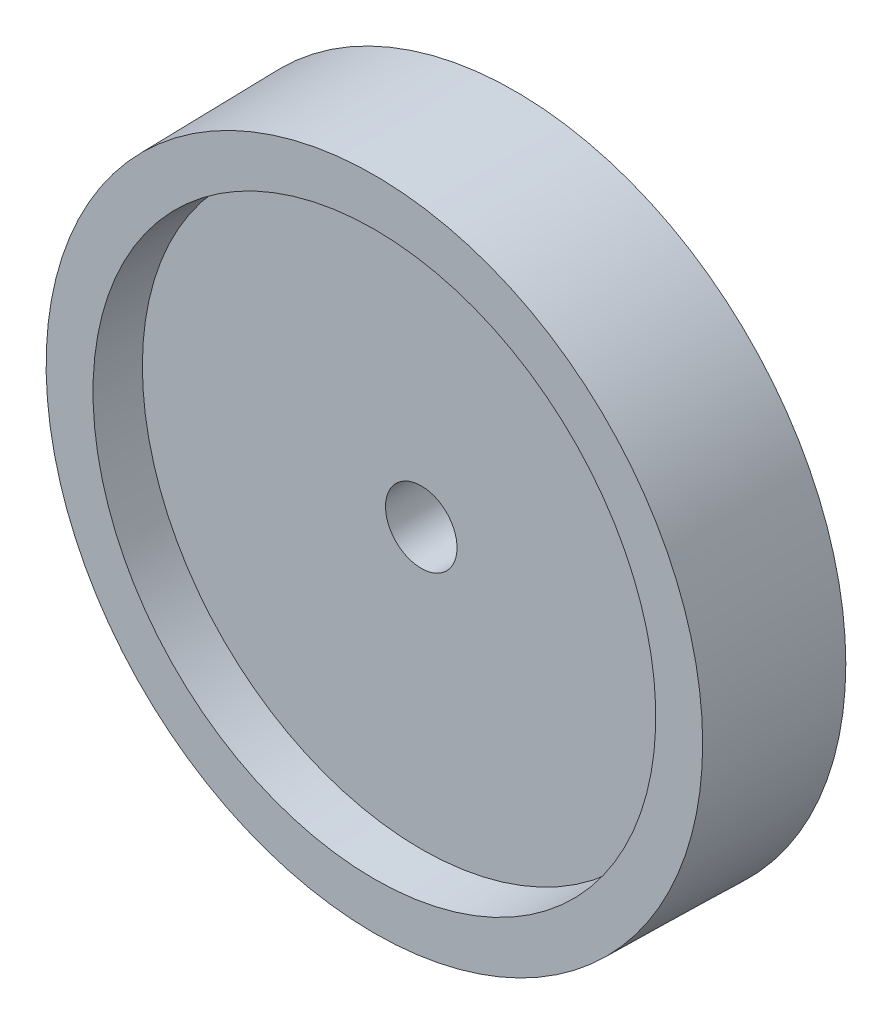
ISO-10303-21;
HEADER;
FILE_DESCRIPTION(('STEP AP214'),'2;1');
FILE_NAME('part.step','',(''),(''),'','','');
FILE_SCHEMA(('AUTOMOTIVE_DESIGN { 1 0 10303 214 1 1 1 1 }'));
ENDSEC;
DATA;
#1=APPLICATION_CONTEXT('core data for automotive mechanical design processes');
#2=APPLICATION_PROTOCOL_DEFINITION('international standard','automotive_design',2000,#1);
#3=PRODUCT_CONTEXT('',#1,'mechanical');
#4=PRODUCT('Part','Part','',(#3));
#5=PRODUCT_RELATED_PRODUCT_CATEGORY('part','',(#4));
#6=PRODUCT_DEFINITION_FORMATION('','',#4);
#7=PRODUCT_DEFINITION_CONTEXT('part definition',#1,'design');
#8=PRODUCT_DEFINITION('design','',#6,#7);
#9=PRODUCT_DEFINITION_SHAPE('','',#8);
#10=(LENGTH_UNIT() NAMED_UNIT(*) SI_UNIT(.MILLI.,.METRE.));
#11=(NAMED_UNIT(*) PLANE_ANGLE_UNIT() SI_UNIT($,.RADIAN.));
#12=(NAMED_UNIT(*) SI_UNIT($,.STERADIAN.) SOLID_ANGLE_UNIT());
#13=UNCERTAINTY_MEASURE_WITH_UNIT(LENGTH_MEASURE(1.E-05),#10,'distance_accuracy_value','');
#14=(GEOMETRIC_REPRESENTATION_CONTEXT(3) GLOBAL_UNCERTAINTY_ASSIGNED_CONTEXT((#13)) GLOBAL_UNIT_ASSIGNED_CONTEXT((#10,
#11,#12)) REPRESENTATION_CONTEXT('',''));
#15=CARTESIAN_POINT('',(0.,0.,0.));
#16=DIRECTION('',(0.,0.,1.));
#17=DIRECTION('',(1.,0.,0.));
#18=AXIS2_PLACEMENT_3D('',#15,#16,#17);
#19=CARTESIAN_POINT('',(-80.402546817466,-55.270743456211,2.00999999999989));
#20=DIRECTION('',(0.,0.,-1.));
#21=DIRECTION('',(0.,1.,0.));
#22=AXIS2_PLACEMENT_3D('',#19,#20,#21);
#23=PLANE('',#22);
#24=CARTESIAN_POINT('',(-80.402546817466,-55.270743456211,2.00999999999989));
#25=DIRECTION('',(0.,0.,-1.));
#26=DIRECTION('',(-1.,0.,0.));
#27=AXIS2_PLACEMENT_3D('',#24,#25,#26);
#28=CIRCLE('',#27,11.9546603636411);
#29=CARTESIAN_POINT('',(-92.3572071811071,-55.270743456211,2.00999999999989));
#30=VERTEX_POINT('',#29);
#31=EDGE_CURVE('E10',#30,#30,#28,.F.);
#32=ORIENTED_EDGE('',*,*,#31,.F.);
#33=EDGE_LOOP('',(#32));
#34=FACE_BOUND('',#33,.T.);
#35=CARTESIAN_POINT('',(-80.402546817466,-55.270743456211,2.00999999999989));
#36=DIRECTION('',(0.,0.,-1.));
#37=DIRECTION('',(0.,1.,0.));
#38=AXIS2_PLACEMENT_3D('',#35,#36,#37);
#39=CIRCLE('',#38,3.5175);
#40=CARTESIAN_POINT('',(-80.402546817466,-51.753243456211,2.00999999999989));
#41=VERTEX_POINT('',#40);
#42=EDGE_CURVE('E35',#41,#41,#39,.T.);
#43=ORIENTED_EDGE('',*,*,#42,.F.);
#44=EDGE_LOOP('',(#43));
#45=FACE_BOUND('',#44,.T.);
#46=ADVANCED_FACE('F14',(#34,#45),#23,.T.);
#47=CARTESIAN_POINT('',(-80.402546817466,-55.270743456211,4.01999999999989));
#48=DIRECTION('',(0.,0.,-1.));
#49=DIRECTION('',(0.,1.,0.));
#50=AXIS2_PLACEMENT_3D('',#47,#48,#49);
#51=PLANE('',#50);
#52=CARTESIAN_POINT('',(-80.402546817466,-55.270743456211,4.01999999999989));
#53=DIRECTION('',(0.,0.,-1.));
#54=DIRECTION('',(-1.,0.,0.));
#55=AXIS2_PLACEMENT_3D('',#52,#53,#54);
#56=CIRCLE('',#55,11.9546603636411);
#57=CARTESIAN_POINT('',(-92.3572071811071,-55.270743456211,4.01999999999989));
#58=VERTEX_POINT('',#57);
#59=EDGE_CURVE('E57',#58,#58,#56,.F.);
#60=ORIENTED_EDGE('',*,*,#59,.T.);
#61=EDGE_LOOP('',(#60));
#62=FACE_BOUND('',#61,.T.);
#63=CARTESIAN_POINT('',(-80.402546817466,-55.270743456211,4.01999999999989));
#64=DIRECTION('',(0.,0.,-1.));
#65=DIRECTION('',(0.,1.,0.));
#66=AXIS2_PLACEMENT_3D('',#63,#64,#65);
#67=CIRCLE('',#66,1.532625);
#68=CARTESIAN_POINT('',(-80.402546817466,-53.738118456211,4.01999999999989));
#69=VERTEX_POINT('',#68);
#70=EDGE_CURVE('E48',#69,#69,#67,.T.);
#71=ORIENTED_EDGE('',*,*,#70,.T.);
#72=EDGE_LOOP('',(#71));
#73=FACE_BOUND('',#72,.T.);
#74=ADVANCED_FACE('F96',(#62,#73),#51,.F.);
#75=CARTESIAN_POINT('',(-80.402546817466,-55.270743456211,2.00999999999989));
#76=DIRECTION('',(0.,0.,1.));
#77=DIRECTION('',(0.,1.,0.));
#78=AXIS2_PLACEMENT_3D('',#75,#76,#77);
#79=CONICAL_SURFACE('',#78,3.5175,0.05235987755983);
#80=CARTESIAN_POINT('',(-80.402546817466,-55.270743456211,-2.01000000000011));
#81=DIRECTION('',(0.,0.,-1.));
#82=DIRECTION('',(0.,1.,0.));
#83=AXIS2_PLACEMENT_3D('',#80,#81,#82);
#84=CIRCLE('',#83,3.30682072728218);
#85=CARTESIAN_POINT('',(-80.402546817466,-51.9639227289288,-2.01000000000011));
#86=VERTEX_POINT('',#85);
#87=EDGE_CURVE('E22',#86,#86,#84,.T.);
#88=ORIENTED_EDGE('',*,*,#87,.F.);
#89=EDGE_LOOP('',(#88));
#90=FACE_BOUND('',#89,.T.);
#91=ORIENTED_EDGE('',*,*,#42,.T.);
#92=EDGE_LOOP('',(#91));
#93=FACE_BOUND('',#92,.T.);
#94=ADVANCED_FACE('F107',(#90,#93),#79,.T.);
#95=CARTESIAN_POINT('',(-80.402546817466,-55.270743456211,-2.01000000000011));
#96=DIRECTION('',(0.,0.,-1.));
#97=DIRECTION('',(0.,1.,0.));
#98=AXIS2_PLACEMENT_3D('',#95,#96,#97);
#99=PLANE('',#98);
#100=CARTESIAN_POINT('',(-80.402546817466,-55.270743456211,-2.01000000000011));
#101=DIRECTION('',(0.,0.,-1.));
#102=DIRECTION('',(0.,1.,0.));
#103=AXIS2_PLACEMENT_3D('',#100,#101,#102);
#104=CIRCLE('',#103,1.532625);
#105=CARTESIAN_POINT('',(-80.402546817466,-53.738118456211,-2.01000000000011));
#106=VERTEX_POINT('',#105);
#107=EDGE_CURVE('E60',#106,#106,#104,.T.);
#108=ORIENTED_EDGE('',*,*,#107,.F.);
#109=EDGE_LOOP('',(#108));
#110=FACE_BOUND('',#109,.T.);
#111=ORIENTED_EDGE('',*,*,#87,.T.);
#112=EDGE_LOOP('',(#111));
#113=FACE_BOUND('',#112,.T.);
#114=ADVANCED_FACE('F102',(#110,#113),#99,.T.);
#115=CARTESIAN_POINT('',(-80.402546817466,-55.270743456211,4.01999999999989));
#116=DIRECTION('',(0.,0.,-1.));
#117=DIRECTION('',(0.,1.,0.));
#118=AXIS2_PLACEMENT_3D('',#115,#116,#117);
#119=CYLINDRICAL_SURFACE('',#118,1.532625);
#120=ORIENTED_EDGE('',*,*,#70,.F.);
#121=EDGE_LOOP('',(#120));
#122=FACE_BOUND('',#121,.T.);
#123=ORIENTED_EDGE('',*,*,#107,.T.);
#124=EDGE_LOOP('',(#123));
#125=FACE_BOUND('',#124,.T.);
#126=ADVANCED_FACE('F98',(#122,#125),#119,.F.);
#127=CARTESIAN_POINT('',(-80.402546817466,-55.270743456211,6.02999999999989));
#128=DIRECTION('',(0.,0.,1.));
#129=DIRECTION('',(0.,-1.,0.));
#130=AXIS2_PLACEMENT_3D('',#127,#128,#129);
#131=PLANE('',#130);
#132=CARTESIAN_POINT('',(-80.402546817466,-55.270743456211,6.02999999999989));
#133=DIRECTION('',(0.,0.,1.));
#134=DIRECTION('',(0.,-1.,0.));
#135=AXIS2_PLACEMENT_3D('',#132,#133,#134);
#136=CIRCLE('',#135,14.07);
#137=CARTESIAN_POINT('',(-80.402546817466,-69.340743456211,6.02999999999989));
#138=VERTEX_POINT('',#137);
#139=EDGE_CURVE('E61',#138,#138,#136,.T.);
#140=ORIENTED_EDGE('',*,*,#139,.T.);
#141=EDGE_LOOP('',(#140));
#142=FACE_BOUND('',#141,.T.);
#143=CARTESIAN_POINT('',(-80.402546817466,-55.270743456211,6.02999999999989));
#144=DIRECTION('',(0.,0.,1.));
#145=DIRECTION('',(0.,-1.,0.));
#146=AXIS2_PLACEMENT_3D('',#143,#144,#145);
#147=CIRCLE('',#146,12.06);
#148=CARTESIAN_POINT('',(-80.402546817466,-67.330743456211,6.02999999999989));
#149=VERTEX_POINT('',#148);
#150=EDGE_CURVE('E55',#149,#149,#147,.T.);
#151=ORIENTED_EDGE('',*,*,#150,.F.);
#152=EDGE_LOOP('',(#151));
#153=FACE_BOUND('',#152,.T.);
#154=ADVANCED_FACE('F101',(#142,#153),#131,.T.);
#155=CARTESIAN_POINT('',(-80.402546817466,-55.270743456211,6.02999999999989));
#156=DIRECTION('',(0.,0.,1.));
#157=DIRECTION('',(1.,0.,0.));
#158=AXIS2_PLACEMENT_3D('',#155,#156,#157);
#159=CONICAL_SURFACE('',#158,12.06,0.0523598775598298);
#160=ORIENTED_EDGE('',*,*,#150,.T.);
#161=EDGE_LOOP('',(#160));
#162=FACE_BOUND('',#161,.T.);
#163=ORIENTED_EDGE('',*,*,#59,.F.);
#164=EDGE_LOOP('',(#163));
#165=FACE_BOUND('',#164,.T.);
#166=ADVANCED_FACE('F126',(#162,#165),#159,.F.);
#167=CARTESIAN_POINT('',(-80.402546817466,-55.270743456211,6.02999999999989));
#168=DIRECTION('',(0.,0.,-1.));
#169=DIRECTION('',(1.,0.,0.));
#170=AXIS2_PLACEMENT_3D('',#167,#168,#169);
#171=CONICAL_SURFACE('',#170,14.07,0.0174532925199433);
#172=ORIENTED_EDGE('',*,*,#139,.F.);
#173=EDGE_LOOP('',(#172));
#174=FACE_BOUND('',#173,.T.);
#175=CARTESIAN_POINT('',(-80.402546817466,-55.270743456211,-1.09834016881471E-13));
#176=DIRECTION('',(0.,0.,1.));
#177=DIRECTION('',(1.,0.,0.));
#178=AXIS2_PLACEMENT_3D('',#175,#176,#177);
#179=CIRCLE('',#178,14.1752540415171);
#180=CARTESIAN_POINT('',(-66.2272927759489,-55.270743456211,-1.08098106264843E-13));
#181=VERTEX_POINT('',#180);
#182=EDGE_CURVE('E52',#181,#181,#179,.T.);
#183=ORIENTED_EDGE('',*,*,#182,.T.);
#184=EDGE_LOOP('',(#183));
#185=FACE_BOUND('',#184,.T.);
#186=ADVANCED_FACE('F124',(#174,#185),#171,.T.);
#187=CARTESIAN_POINT('',(-80.402546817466,-55.270743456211,-1.09834016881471E-13));
#188=DIRECTION('',(0.,0.,-1.));
#189=DIRECTION('',(-1.,0.,0.));
#190=AXIS2_PLACEMENT_3D('',#187,#188,#189);
#191=CONICAL_SURFACE('',#190,12.06,0.0523598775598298);
#192=ORIENTED_EDGE('',*,*,#31,.T.);
#193=EDGE_LOOP('',(#192));
#194=FACE_BOUND('',#193,.T.);
#195=CARTESIAN_POINT('',(-80.402546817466,-55.270743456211,-1.09834016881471E-13));
#196=DIRECTION('',(0.,0.,1.));
#197=DIRECTION('',(0.,-1.,0.));
#198=AXIS2_PLACEMENT_3D('',#195,#196,#197);
#199=CIRCLE('',#198,12.06);
#200=CARTESIAN_POINT('',(-80.402546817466,-67.330743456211,-1.09834016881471E-13));
#201=VERTEX_POINT('',#200);
#202=EDGE_CURVE('E56',#201,#201,#199,.T.);
#203=ORIENTED_EDGE('',*,*,#202,.F.);
#204=EDGE_LOOP('',(#203));
#205=FACE_BOUND('',#204,.T.);
#206=ADVANCED_FACE('F16',(#194,#205),#191,.F.);
#207=CARTESIAN_POINT('',(-80.402546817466,-55.270743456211,-1.09834016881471E-13));
#208=DIRECTION('',(0.,0.,1.));
#209=DIRECTION('',(0.,-1.,0.));
#210=AXIS2_PLACEMENT_3D('',#207,#208,#209);
#211=PLANE('',#210);
#212=ORIENTED_EDGE('',*,*,#202,.T.);
#213=EDGE_LOOP('',(#212));
#214=FACE_BOUND('',#213,.T.);
#215=ORIENTED_EDGE('',*,*,#182,.F.);
#216=EDGE_LOOP('',(#215));
#217=FACE_BOUND('',#216,.T.);
#218=ADVANCED_FACE('F140',(#214,#217),#211,.F.);
#219=CLOSED_SHELL('',(#46,#74,#94,#114,#126,#154,#166,#186,#206,#218));
#220=MANIFOLD_SOLID_BREP('B1',#219);
#221=ADVANCED_BREP_SHAPE_REPRESENTATION('',(#18,#220),#14);
#222=SHAPE_DEFINITION_REPRESENTATION(#9,#221);
ENDSEC;
END-ISO-10303-21;
